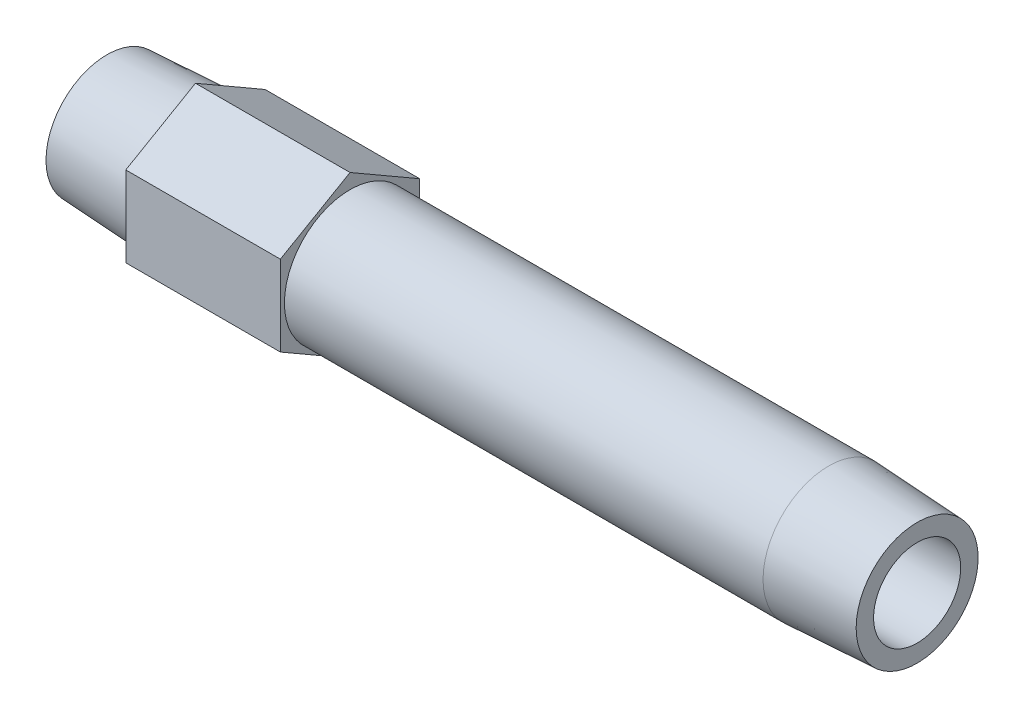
ISO-10303-21;
HEADER;
FILE_DESCRIPTION(('STEP AP214'),'2;1');
FILE_NAME('part.step','',(''),(''),'','','');
FILE_SCHEMA(('AUTOMOTIVE_DESIGN { 1 0 10303 214 1 1 1 1 }'));
ENDSEC;
DATA;
#1=APPLICATION_CONTEXT('core data for automotive mechanical design processes');
#2=APPLICATION_PROTOCOL_DEFINITION('international standard','automotive_design',2000,#1);
#3=PRODUCT_CONTEXT('',#1,'mechanical');
#4=PRODUCT('Part','Part','',(#3));
#5=PRODUCT_RELATED_PRODUCT_CATEGORY('part','',(#4));
#6=PRODUCT_DEFINITION_FORMATION('','',#4);
#7=PRODUCT_DEFINITION_CONTEXT('part definition',#1,'design');
#8=PRODUCT_DEFINITION('design','',#6,#7);
#9=PRODUCT_DEFINITION_SHAPE('','',#8);
#10=(LENGTH_UNIT() NAMED_UNIT(*) SI_UNIT(.MILLI.,.METRE.));
#11=(NAMED_UNIT(*) PLANE_ANGLE_UNIT() SI_UNIT($,.RADIAN.));
#12=(NAMED_UNIT(*) SI_UNIT($,.STERADIAN.) SOLID_ANGLE_UNIT());
#13=UNCERTAINTY_MEASURE_WITH_UNIT(LENGTH_MEASURE(1.E-05),#10,'distance_accuracy_value','');
#14=(GEOMETRIC_REPRESENTATION_CONTEXT(3) GLOBAL_UNCERTAINTY_ASSIGNED_CONTEXT((#13)) GLOBAL_UNIT_ASSIGNED_CONTEXT((#10,
#11,#12)) REPRESENTATION_CONTEXT('',''));
#15=CARTESIAN_POINT('',(0.,0.,0.));
#16=DIRECTION('',(0.,0.,1.));
#17=DIRECTION('',(1.,0.,0.));
#18=AXIS2_PLACEMENT_3D('',#15,#16,#17);
#19=CARTESIAN_POINT('',(0.,0.,-4.78009397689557));
#20=DIRECTION('',(1.,0.,0.));
#21=DIRECTION('',(0.,0.,-1.));
#22=AXIS2_PLACEMENT_3D('',#19,#20,#21);
#23=PLANE('',#22);
#24=CARTESIAN_POINT('',(0.,0.,0.));
#25=DIRECTION('',(-1.,0.,0.));
#26=DIRECTION('',(0.,0.,1.));
#27=AXIS2_PLACEMENT_3D('',#24,#25,#26);
#28=CIRCLE('',#27,4.78009397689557);
#29=CARTESIAN_POINT('',(0.,0.,4.78009397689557));
#30=VERTEX_POINT('',#29);
#31=EDGE_CURVE('E147',#30,#30,#28,.T.);
#32=ORIENTED_EDGE('',*,*,#31,.T.);
#33=EDGE_LOOP('',(#32));
#34=FACE_BOUND('',#33,.T.);
#35=CARTESIAN_POINT('',(0.,0.,0.));
#36=DIRECTION('',(1.,0.,0.));
#37=DIRECTION('',(0.,0.,1.));
#38=AXIS2_PLACEMENT_3D('',#35,#36,#37);
#39=CIRCLE('',#38,3.4163);
#40=CARTESIAN_POINT('',(0.,0.,3.4163));
#41=VERTEX_POINT('',#40);
#42=EDGE_CURVE('E159',#41,#41,#39,.T.);
#43=ORIENTED_EDGE('',*,*,#42,.T.);
#44=EDGE_LOOP('',(#43));
#45=FACE_BOUND('',#44,.T.);
#46=ADVANCED_FACE('F15',(#34,#45),#23,.F.);
#47=CARTESIAN_POINT('',(63.5,0.,-4.78009397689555));
#48=DIRECTION('',(-1.,0.,0.));
#49=DIRECTION('',(0.,0.,1.));
#50=AXIS2_PLACEMENT_3D('',#47,#48,#49);
#51=PLANE('',#50);
#52=CARTESIAN_POINT('',(63.5,0.,0.));
#53=DIRECTION('',(-1.,0.,0.));
#54=DIRECTION('',(0.,0.,1.));
#55=AXIS2_PLACEMENT_3D('',#52,#53,#54);
#56=CIRCLE('',#55,4.78009397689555);
#57=CARTESIAN_POINT('',(63.5,0.,4.78009397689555));
#58=VERTEX_POINT('',#57);
#59=EDGE_CURVE('E150',#58,#58,#56,.T.);
#60=ORIENTED_EDGE('',*,*,#59,.F.);
#61=EDGE_LOOP('',(#60));
#62=FACE_BOUND('',#61,.T.);
#63=CARTESIAN_POINT('',(63.5,0.,0.));
#64=DIRECTION('',(-1.,0.,0.));
#65=DIRECTION('',(0.,0.,1.));
#66=AXIS2_PLACEMENT_3D('',#63,#64,#65);
#67=CIRCLE('',#66,3.4163);
#68=CARTESIAN_POINT('',(63.5,0.,3.4163));
#69=VERTEX_POINT('',#68);
#70=EDGE_CURVE('E156',#69,#69,#67,.F.);
#71=ORIENTED_EDGE('',*,*,#70,.F.);
#72=EDGE_LOOP('',(#71));
#73=FACE_BOUND('',#72,.T.);
#74=ADVANCED_FACE('F178',(#62,#73),#51,.F.);
#75=CARTESIAN_POINT('',(19.05,-9.45872946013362,5.461));
#76=DIRECTION('',(-1.,0.,0.));
#77=DIRECTION('',(0.,-1.,0.));
#78=AXIS2_PLACEMENT_3D('',#75,#76,#77);
#79=PLANE('',#78);
#80=DIRECTION('',(0.,0.5,-0.866025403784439));
#81=VECTOR('',#80,1.);
#82=CARTESIAN_POINT('',(19.05,-6.30581964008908,0.));
#83=LINE('',#82,#81);
#84=CARTESIAN_POINT('',(19.05,-6.30581964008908,0.));
#85=VERTEX_POINT('',#84);
#86=CARTESIAN_POINT('',(19.05,-3.15290982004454,-5.461));
#87=VERTEX_POINT('',#86);
#88=EDGE_CURVE('E103',#85,#87,#83,.T.);
#89=ORIENTED_EDGE('',*,*,#88,.T.);
#90=DIRECTION('',(0.,1.,0.));
#91=VECTOR('',#90,1.);
#92=CARTESIAN_POINT('',(19.05,-3.15290982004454,-5.461));
#93=LINE('',#92,#91);
#94=CARTESIAN_POINT('',(19.05,3.15290982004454,-5.461));
#95=VERTEX_POINT('',#94);
#96=EDGE_CURVE('E83',#87,#95,#93,.T.);
#97=ORIENTED_EDGE('',*,*,#96,.T.);
#98=DIRECTION('',(0.,0.5,0.866025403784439));
#99=VECTOR('',#98,1.);
#100=CARTESIAN_POINT('',(19.05,3.15290982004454,-5.461));
#101=LINE('',#100,#99);
#102=CARTESIAN_POINT('',(19.05,6.30581964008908,0.));
#103=VERTEX_POINT('',#102);
#104=EDGE_CURVE('E102',#95,#103,#101,.T.);
#105=ORIENTED_EDGE('',*,*,#104,.T.);
#106=DIRECTION('',(0.,-0.5,0.866025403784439));
#107=VECTOR('',#106,1.);
#108=CARTESIAN_POINT('',(19.05,6.30581964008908,0.));
#109=LINE('',#108,#107);
#110=CARTESIAN_POINT('',(19.05,3.15290982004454,5.461));
#111=VERTEX_POINT('',#110);
#112=EDGE_CURVE('E105',#103,#111,#109,.T.);
#113=ORIENTED_EDGE('',*,*,#112,.T.);
#114=DIRECTION('',(0.,-1.,0.));
#115=VECTOR('',#114,1.);
#116=CARTESIAN_POINT('',(19.05,3.15290982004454,5.461));
#117=LINE('',#116,#115);
#118=CARTESIAN_POINT('',(19.05,-3.15290982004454,5.461));
#119=VERTEX_POINT('',#118);
#120=EDGE_CURVE('E35',#111,#119,#117,.T.);
#121=ORIENTED_EDGE('',*,*,#120,.T.);
#122=DIRECTION('',(0.,-0.5,-0.866025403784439));
#123=VECTOR('',#122,1.);
#124=CARTESIAN_POINT('',(19.05,-3.15290982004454,5.461));
#125=LINE('',#124,#123);
#126=EDGE_CURVE('E30',#119,#85,#125,.T.);
#127=ORIENTED_EDGE('',*,*,#126,.T.);
#128=EDGE_LOOP('',(#89,#97,#105,#113,#121,#127));
#129=FACE_BOUND('',#128,.T.);
#130=CARTESIAN_POINT('',(19.05,0.,0.));
#131=DIRECTION('',(-1.,0.,0.));
#132=DIRECTION('',(0.,-1.,0.));
#133=AXIS2_PLACEMENT_3D('',#130,#131,#132);
#134=CIRCLE('',#133,5.1435);
#135=CARTESIAN_POINT('',(19.05,-5.1435,0.));
#136=VERTEX_POINT('',#135);
#137=EDGE_CURVE('E89',#136,#136,#134,.F.);
#138=ORIENTED_EDGE('',*,*,#137,.F.);
#139=EDGE_LOOP('',(#138));
#140=FACE_BOUND('',#139,.T.);
#141=ADVANCED_FACE('F124',(#129,#140),#79,.F.);
#142=CARTESIAN_POINT('',(6.9342,-9.45872946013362,5.461));
#143=DIRECTION('',(-1.,0.,0.));
#144=DIRECTION('',(0.,-1.,0.));
#145=AXIS2_PLACEMENT_3D('',#142,#143,#144);
#146=PLANE('',#145);
#147=DIRECTION('',(0.,0.5,-0.866025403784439));
#148=VECTOR('',#147,1.);
#149=CARTESIAN_POINT('',(6.9342,-6.30581964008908,0.));
#150=LINE('',#149,#148);
#151=CARTESIAN_POINT('',(6.9342,-6.30581964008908,0.));
#152=VERTEX_POINT('',#151);
#153=CARTESIAN_POINT('',(6.9342,-3.15290982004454,-5.461));
#154=VERTEX_POINT('',#153);
#155=EDGE_CURVE('E73',#152,#154,#150,.T.);
#156=ORIENTED_EDGE('',*,*,#155,.F.);
#157=DIRECTION('',(0.,-0.5,-0.866025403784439));
#158=VECTOR('',#157,1.);
#159=CARTESIAN_POINT('',(6.9342,-3.15290982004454,5.461));
#160=LINE('',#159,#158);
#161=CARTESIAN_POINT('',(6.9342,-3.15290982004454,5.461));
#162=VERTEX_POINT('',#161);
#163=EDGE_CURVE('E99',#162,#152,#160,.T.);
#164=ORIENTED_EDGE('',*,*,#163,.F.);
#165=DIRECTION('',(0.,-1.,0.));
#166=VECTOR('',#165,1.);
#167=CARTESIAN_POINT('',(6.9342,3.15290982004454,5.461));
#168=LINE('',#167,#166);
#169=CARTESIAN_POINT('',(6.9342,3.15290982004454,5.461));
#170=VERTEX_POINT('',#169);
#171=EDGE_CURVE('E133',#170,#162,#168,.T.);
#172=ORIENTED_EDGE('',*,*,#171,.F.);
#173=DIRECTION('',(0.,-0.5,0.866025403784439));
#174=VECTOR('',#173,1.);
#175=CARTESIAN_POINT('',(6.9342,6.30581964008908,0.));
#176=LINE('',#175,#174);
#177=CARTESIAN_POINT('',(6.9342,6.30581964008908,0.));
#178=VERTEX_POINT('',#177);
#179=EDGE_CURVE('E129',#178,#170,#176,.T.);
#180=ORIENTED_EDGE('',*,*,#179,.F.);
#181=DIRECTION('',(0.,0.5,0.866025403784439));
#182=VECTOR('',#181,1.);
#183=CARTESIAN_POINT('',(6.9342,3.15290982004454,-5.461));
#184=LINE('',#183,#182);
#185=CARTESIAN_POINT('',(6.9342,3.15290982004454,-5.461));
#186=VERTEX_POINT('',#185);
#187=EDGE_CURVE('E75',#186,#178,#184,.T.);
#188=ORIENTED_EDGE('',*,*,#187,.F.);
#189=DIRECTION('',(0.,1.,0.));
#190=VECTOR('',#189,1.);
#191=CARTESIAN_POINT('',(6.9342,-3.15290982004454,-5.461));
#192=LINE('',#191,#190);
#193=EDGE_CURVE('E68',#154,#186,#192,.T.);
#194=ORIENTED_EDGE('',*,*,#193,.F.);
#195=EDGE_LOOP('',(#156,#164,#172,#180,#188,#194));
#196=FACE_BOUND('',#195,.T.);
#197=CARTESIAN_POINT('',(6.9342,0.,0.));
#198=DIRECTION('',(-1.,0.,0.));
#199=DIRECTION('',(0.,0.,1.));
#200=AXIS2_PLACEMENT_3D('',#197,#198,#199);
#201=CIRCLE('',#200,5.1435);
#202=CARTESIAN_POINT('',(6.9342,0.,5.1435));
#203=VERTEX_POINT('',#202);
#204=EDGE_CURVE('E95',#203,#203,#201,.T.);
#205=ORIENTED_EDGE('',*,*,#204,.F.);
#206=EDGE_LOOP('',(#205));
#207=FACE_BOUND('',#206,.T.);
#208=ADVANCED_FACE('F69',(#196,#207),#146,.T.);
#209=CARTESIAN_POINT('',(19.05,-6.30581964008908,0.));
#210=DIRECTION('',(0.,0.866025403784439,0.5));
#211=DIRECTION('',(0.,-0.5,0.866025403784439));
#212=AXIS2_PLACEMENT_3D('',#209,#210,#211);
#213=PLANE('',#212);
#214=ORIENTED_EDGE('',*,*,#155,.T.);
#215=DIRECTION('',(-1.,0.,0.));
#216=VECTOR('',#215,1.);
#217=CARTESIAN_POINT('',(19.05,-3.15290982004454,-5.461));
#218=LINE('',#217,#216);
#219=EDGE_CURVE('E10',#87,#154,#218,.T.);
#220=ORIENTED_EDGE('',*,*,#219,.F.);
#221=ORIENTED_EDGE('',*,*,#88,.F.);
#222=DIRECTION('',(-1.,0.,0.));
#223=VECTOR('',#222,1.);
#224=CARTESIAN_POINT('',(19.05,-6.30581964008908,0.));
#225=LINE('',#224,#223);
#226=EDGE_CURVE('E87',#85,#152,#225,.T.);
#227=ORIENTED_EDGE('',*,*,#226,.T.);
#228=EDGE_LOOP('',(#214,#220,#221,#227));
#229=FACE_BOUND('',#228,.T.);
#230=ADVANCED_FACE('F17',(#229),#213,.F.);
#231=CARTESIAN_POINT('',(19.05,-3.15290982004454,-5.461));
#232=DIRECTION('',(0.,0.,1.));
#233=DIRECTION('',(0.,-1.,0.));
#234=AXIS2_PLACEMENT_3D('',#231,#232,#233);
#235=PLANE('',#234);
#236=ORIENTED_EDGE('',*,*,#193,.T.);
#237=DIRECTION('',(-1.,0.,0.));
#238=VECTOR('',#237,1.);
#239=CARTESIAN_POINT('',(19.05,3.15290982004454,-5.461));
#240=LINE('',#239,#238);
#241=EDGE_CURVE('E23',#95,#186,#240,.T.);
#242=ORIENTED_EDGE('',*,*,#241,.F.);
#243=ORIENTED_EDGE('',*,*,#96,.F.);
#244=ORIENTED_EDGE('',*,*,#219,.T.);
#245=EDGE_LOOP('',(#236,#242,#243,#244));
#246=FACE_BOUND('',#245,.T.);
#247=ADVANCED_FACE('F82',(#246),#235,.F.);
#248=CARTESIAN_POINT('',(19.05,3.15290982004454,-5.461));
#249=DIRECTION('',(0.,-0.866025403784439,0.5));
#250=DIRECTION('',(0.,-0.5,-0.866025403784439));
#251=AXIS2_PLACEMENT_3D('',#248,#249,#250);
#252=PLANE('',#251);
#253=ORIENTED_EDGE('',*,*,#187,.T.);
#254=DIRECTION('',(-1.,0.,0.));
#255=VECTOR('',#254,1.);
#256=CARTESIAN_POINT('',(19.05,6.30581964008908,0.));
#257=LINE('',#256,#255);
#258=EDGE_CURVE('E117',#103,#178,#257,.T.);
#259=ORIENTED_EDGE('',*,*,#258,.F.);
#260=ORIENTED_EDGE('',*,*,#104,.F.);
#261=ORIENTED_EDGE('',*,*,#241,.T.);
#262=EDGE_LOOP('',(#253,#259,#260,#261));
#263=FACE_BOUND('',#262,.T.);
#264=ADVANCED_FACE('F121',(#263),#252,.F.);
#265=CARTESIAN_POINT('',(19.05,6.30581964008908,0.));
#266=DIRECTION('',(0.,-0.866025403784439,-0.5));
#267=DIRECTION('',(0.,0.5,-0.866025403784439));
#268=AXIS2_PLACEMENT_3D('',#265,#266,#267);
#269=PLANE('',#268);
#270=ORIENTED_EDGE('',*,*,#179,.T.);
#271=DIRECTION('',(-1.,0.,0.));
#272=VECTOR('',#271,1.);
#273=CARTESIAN_POINT('',(19.05,3.15290982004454,5.461));
#274=LINE('',#273,#272);
#275=EDGE_CURVE('E114',#111,#170,#274,.T.);
#276=ORIENTED_EDGE('',*,*,#275,.F.);
#277=ORIENTED_EDGE('',*,*,#112,.F.);
#278=ORIENTED_EDGE('',*,*,#258,.T.);
#279=EDGE_LOOP('',(#270,#276,#277,#278));
#280=FACE_BOUND('',#279,.T.);
#281=ADVANCED_FACE('F128',(#280),#269,.F.);
#282=CARTESIAN_POINT('',(19.05,3.15290982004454,5.461));
#283=DIRECTION('',(0.,0.,-1.));
#284=DIRECTION('',(-1.,0.,0.));
#285=AXIS2_PLACEMENT_3D('',#282,#283,#284);
#286=PLANE('',#285);
#287=ORIENTED_EDGE('',*,*,#171,.T.);
#288=DIRECTION('',(-1.,0.,0.));
#289=VECTOR('',#288,1.);
#290=CARTESIAN_POINT('',(19.05,-3.15290982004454,5.461));
#291=LINE('',#290,#289);
#292=EDGE_CURVE('E111',#119,#162,#291,.T.);
#293=ORIENTED_EDGE('',*,*,#292,.F.);
#294=ORIENTED_EDGE('',*,*,#120,.F.);
#295=ORIENTED_EDGE('',*,*,#275,.T.);
#296=EDGE_LOOP('',(#287,#293,#294,#295));
#297=FACE_BOUND('',#296,.T.);
#298=ADVANCED_FACE('F132',(#297),#286,.F.);
#299=CARTESIAN_POINT('',(19.05,-3.15290982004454,5.461));
#300=DIRECTION('',(0.,0.866025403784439,-0.5));
#301=DIRECTION('',(0.,0.5,0.866025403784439));
#302=AXIS2_PLACEMENT_3D('',#299,#300,#301);
#303=PLANE('',#302);
#304=ORIENTED_EDGE('',*,*,#163,.T.);
#305=ORIENTED_EDGE('',*,*,#226,.F.);
#306=ORIENTED_EDGE('',*,*,#126,.F.);
#307=ORIENTED_EDGE('',*,*,#292,.T.);
#308=EDGE_LOOP('',(#304,#305,#306,#307));
#309=FACE_BOUND('',#308,.T.);
#310=ADVANCED_FACE('F135',(#309),#303,.F.);
#311=CARTESIAN_POINT('',(6.9342,0.,0.));
#312=DIRECTION('',(1.,0.,0.));
#313=DIRECTION('',(0.,0.,-1.));
#314=AXIS2_PLACEMENT_3D('',#311,#312,#313);
#315=CONICAL_SURFACE('',#314,5.1435,0.0523598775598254);
#316=ORIENTED_EDGE('',*,*,#31,.F.);
#317=EDGE_LOOP('',(#316));
#318=FACE_BOUND('',#317,.T.);
#319=ORIENTED_EDGE('',*,*,#204,.T.);
#320=EDGE_LOOP('',(#319));
#321=FACE_BOUND('',#320,.T.);
#322=ADVANCED_FACE('F187',(#318,#321),#315,.T.);
#323=CARTESIAN_POINT('',(-60.,0.,0.));
#324=DIRECTION('',(-1.,0.,0.));
#325=DIRECTION('',(0.,0.,1.));
#326=AXIS2_PLACEMENT_3D('',#323,#324,#325);
#327=CYLINDRICAL_SURFACE('',#326,5.1435);
#328=ORIENTED_EDGE('',*,*,#137,.T.);
#329=EDGE_LOOP('',(#328));
#330=FACE_BOUND('',#329,.T.);
#331=CARTESIAN_POINT('',(56.5658,0.,0.));
#332=DIRECTION('',(-1.,0.,0.));
#333=DIRECTION('',(0.,0.,1.));
#334=AXIS2_PLACEMENT_3D('',#331,#332,#333);
#335=CIRCLE('',#334,5.1435);
#336=CARTESIAN_POINT('',(56.5658,0.,5.1435));
#337=VERTEX_POINT('',#336);
#338=EDGE_CURVE('E153',#337,#337,#335,.T.);
#339=ORIENTED_EDGE('',*,*,#338,.T.);
#340=EDGE_LOOP('',(#339));
#341=FACE_BOUND('',#340,.T.);
#342=ADVANCED_FACE('F174',(#330,#341),#327,.T.);
#343=CARTESIAN_POINT('',(63.5,0.,0.));
#344=DIRECTION('',(-1.,0.,0.));
#345=DIRECTION('',(0.,0.,1.));
#346=AXIS2_PLACEMENT_3D('',#343,#344,#345);
#347=CONICAL_SURFACE('',#346,4.78009397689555,0.052359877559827);
#348=ORIENTED_EDGE('',*,*,#338,.F.);
#349=EDGE_LOOP('',(#348));
#350=FACE_BOUND('',#349,.T.);
#351=ORIENTED_EDGE('',*,*,#59,.T.);
#352=EDGE_LOOP('',(#351));
#353=FACE_BOUND('',#352,.T.);
#354=ADVANCED_FACE('F167',(#350,#353),#347,.T.);
#355=CARTESIAN_POINT('',(65.655110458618,0.,0.));
#356=DIRECTION('',(-1.,0.,0.));
#357=DIRECTION('',(0.,0.,1.));
#358=AXIS2_PLACEMENT_3D('',#355,#356,#357);
#359=CYLINDRICAL_SURFACE('',#358,3.4163);
#360=ORIENTED_EDGE('',*,*,#70,.T.);
#361=EDGE_LOOP('',(#360));
#362=FACE_BOUND('',#361,.T.);
#363=ORIENTED_EDGE('',*,*,#42,.F.);
#364=EDGE_LOOP('',(#363));
#365=FACE_BOUND('',#364,.T.);
#366=ADVANCED_FACE('F165',(#362,#365),#359,.F.);
#367=CLOSED_SHELL('',(#46,#74,#141,#208,#230,#247,#264,#281,#298,#310,#322,#342,#354,#366));
#368=MANIFOLD_SOLID_BREP('B1',#367);
#369=ADVANCED_BREP_SHAPE_REPRESENTATION('',(#18,#368),#14);
#370=SHAPE_DEFINITION_REPRESENTATION(#9,#369);
ENDSEC;
END-ISO-10303-21;
